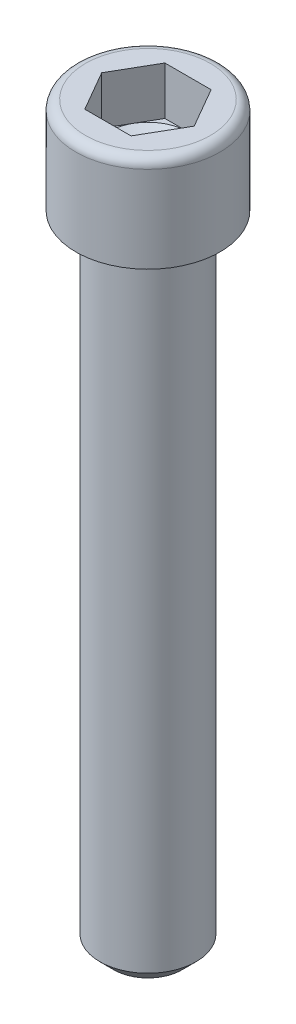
from build123d import *

# Parameters (mm, degrees)
TIGE_START              = -80
ESQUISSE1_R             = 6
TIGE_DEPTH              = 80
CHANFREIN_D_ENTR_E_SIZE = 1.75
HEXAGONE_DEPTH          = 6


with BuildPart() as part:
    # Esquisse1 → Tige (new body)
    with BuildSketch(Plane(origin=(0, 0, 0), x_dir=(1, 0, 0), z_dir=(0, 1, 0)).offset(TIGE_START)):
        with Locations(Location((0, 0, 0), (0, 0, 270))):
            Circle(ESQUISSE1_R)
    extrude(amount=TIGE_DEPTH)

    # Chanfrein d_entr_e
    chanfrein_d_entr_e_edges = [part.edges().sort_by_distance(p)[0] for p in [
        (0, -80, -6),
    ]]
    chamfer(chanfrein_d_entr_e_edges, length=CHANFREIN_D_ENTR_E_SIZE)

    # Esquisse2 → T_te (revolve)
    with BuildSketch(Plane.XY, mode=Mode.PRIVATE) as t_te_sk:
        with BuildLine():
            Line((5, 12), (5, 6))
            Line((5, 6), (0, 3.113248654))
            Line((0, 3.113248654), (0, 0))
            Line((0, 0), (9, 0))
            Line((9, 0), (9, 10.8))
            ThreePointArc((9, 10.8), (8.648528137, 11.648528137), (7.8, 12))
            Line((7.8, 12), (5, 12))
        make_face()
    revolve(t_te_sk.sketch.rotate(Axis((0, 12, 0), (0, -1, 0)), 180), axis=Axis((0, 12, 0), (0, -1, 0)))

    # Esquisse3 → Hexagone (cut)
    with BuildSketch(Plane(origin=(0, 12, -3), x_dir=(1, 0, 0), z_dir=(0, -1, 0))):
        Polygon((2.886751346, 8), (-2.886751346, 8), (-5.773502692, 3), (-2.886751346, -2), (2.886751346, -2), (5.773502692, 3), align=None)
    extrude(amount=HEXAGONE_DEPTH, mode=Mode.SUBTRACT)


solid = part.part
